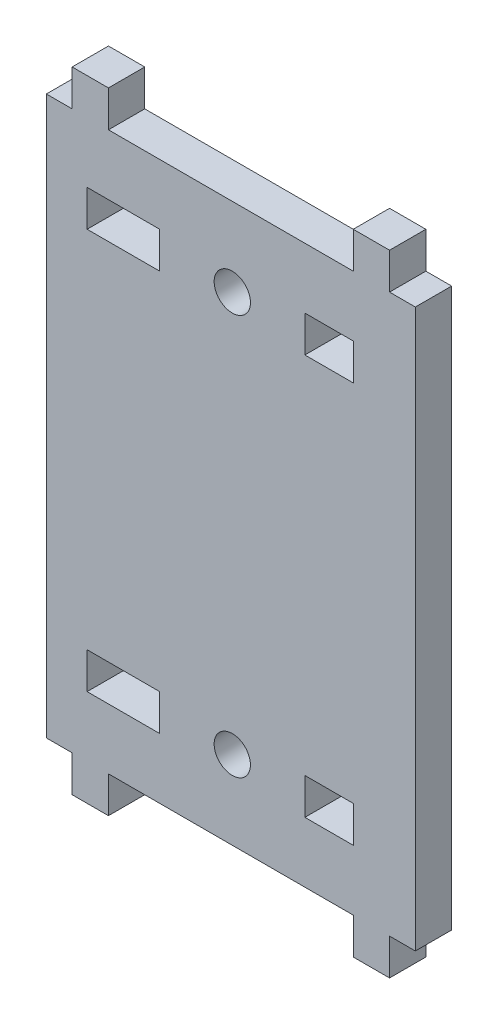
ISO-10303-21;
HEADER;
FILE_DESCRIPTION(('STEP AP214'),'2;1');
FILE_NAME('part.step','',(''),(''),'','','');
FILE_SCHEMA(('AUTOMOTIVE_DESIGN { 1 0 10303 214 1 1 1 1 }'));
ENDSEC;
DATA;
#1=APPLICATION_CONTEXT('core data for automotive mechanical design processes');
#2=APPLICATION_PROTOCOL_DEFINITION('international standard','automotive_design',2000,#1);
#3=PRODUCT_CONTEXT('',#1,'mechanical');
#4=PRODUCT('Part','Part','',(#3));
#5=PRODUCT_RELATED_PRODUCT_CATEGORY('part','',(#4));
#6=PRODUCT_DEFINITION_FORMATION('','',#4);
#7=PRODUCT_DEFINITION_CONTEXT('part definition',#1,'design');
#8=PRODUCT_DEFINITION('design','',#6,#7);
#9=PRODUCT_DEFINITION_SHAPE('','',#8);
#10=(LENGTH_UNIT() NAMED_UNIT(*) SI_UNIT(.MILLI.,.METRE.));
#11=(NAMED_UNIT(*) PLANE_ANGLE_UNIT() SI_UNIT($,.RADIAN.));
#12=(NAMED_UNIT(*) SI_UNIT($,.STERADIAN.) SOLID_ANGLE_UNIT());
#13=UNCERTAINTY_MEASURE_WITH_UNIT(LENGTH_MEASURE(1.E-05),#10,'distance_accuracy_value','');
#14=(GEOMETRIC_REPRESENTATION_CONTEXT(3) GLOBAL_UNCERTAINTY_ASSIGNED_CONTEXT((#13)) GLOBAL_UNIT_ASSIGNED_CONTEXT((#10,
#11,#12)) REPRESENTATION_CONTEXT('',''));
#15=CARTESIAN_POINT('',(0.,0.,0.));
#16=DIRECTION('',(0.,0.,1.));
#17=DIRECTION('',(1.,0.,0.));
#18=AXIS2_PLACEMENT_3D('',#15,#16,#17);
#19=CARTESIAN_POINT('',(0.,209.041147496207,3.));
#20=DIRECTION('',(0.,1.,0.));
#21=DIRECTION('',(0.,0.,1.));
#22=AXIS2_PLACEMENT_3D('',#19,#20,#21);
#23=PLANE('',#22);
#24=DIRECTION('',(1.,0.,0.));
#25=VECTOR('',#24,1.);
#26=CARTESIAN_POINT('',(0.,209.041147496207,0.));
#27=LINE('',#26,#25);
#28=CARTESIAN_POINT('',(45.8205985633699,209.041147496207,0.));
#29=VERTEX_POINT('',#28);
#30=CARTESIAN_POINT('',(47.95248356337,209.041147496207,0.));
#31=VERTEX_POINT('',#30);
#32=EDGE_CURVE('E362',#29,#31,#27,.T.);
#33=ORIENTED_EDGE('',*,*,#32,.F.);
#34=DIRECTION('',(0.,0.,-1.));
#35=VECTOR('',#34,1.);
#36=CARTESIAN_POINT('',(45.8205985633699,209.041147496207,3.));
#37=LINE('',#36,#35);
#38=CARTESIAN_POINT('',(45.8205985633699,209.041147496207,3.));
#39=VERTEX_POINT('',#38);
#40=EDGE_CURVE('E11',#39,#29,#37,.T.);
#41=ORIENTED_EDGE('',*,*,#40,.F.);
#42=DIRECTION('',(1.,0.,0.));
#43=VECTOR('',#42,1.);
#44=CARTESIAN_POINT('',(0.,209.041147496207,3.));
#45=LINE('',#44,#43);
#46=CARTESIAN_POINT('',(47.95248356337,209.041147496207,3.));
#47=VERTEX_POINT('',#46);
#48=EDGE_CURVE('E1035',#39,#47,#45,.T.);
#49=ORIENTED_EDGE('',*,*,#48,.T.);
#50=DIRECTION('',(0.,0.,-1.));
#51=VECTOR('',#50,1.);
#52=CARTESIAN_POINT('',(47.95248356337,209.041147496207,3.));
#53=LINE('',#52,#51);
#54=EDGE_CURVE('E174',#47,#31,#53,.T.);
#55=ORIENTED_EDGE('',*,*,#54,.T.);
#56=EDGE_LOOP('',(#33,#41,#49,#55));
#57=FACE_BOUND('',#56,.T.);
#58=ADVANCED_FACE('F36',(#57),#23,.T.);
#59=CARTESIAN_POINT('',(45.8205985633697,0.,3.));
#60=DIRECTION('',(1.,0.,0.));
#61=DIRECTION('',(0.,1.,0.));
#62=AXIS2_PLACEMENT_3D('',#59,#60,#61);
#63=PLANE('',#62);
#64=DIRECTION('',(0.,-1.,0.));
#65=VECTOR('',#64,1.);
#66=CARTESIAN_POINT('',(45.8205985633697,0.,0.));
#67=LINE('',#66,#65);
#68=CARTESIAN_POINT('',(45.8205985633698,162.941147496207,0.));
#69=VERTEX_POINT('',#68);
#70=EDGE_CURVE('E364',#29,#69,#67,.T.);
#71=ORIENTED_EDGE('',*,*,#70,.T.);
#72=DIRECTION('',(0.,0.,-1.));
#73=VECTOR('',#72,1.);
#74=CARTESIAN_POINT('',(45.8205985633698,162.941147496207,3.));
#75=LINE('',#74,#73);
#76=CARTESIAN_POINT('',(45.8205985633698,162.941147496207,3.));
#77=VERTEX_POINT('',#76);
#78=EDGE_CURVE('E46',#77,#69,#75,.T.);
#79=ORIENTED_EDGE('',*,*,#78,.F.);
#80=DIRECTION('',(0.,-1.,0.));
#81=VECTOR('',#80,1.);
#82=CARTESIAN_POINT('',(45.8205985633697,0.,3.));
#83=LINE('',#82,#81);
#84=EDGE_CURVE('E981',#39,#77,#83,.T.);
#85=ORIENTED_EDGE('',*,*,#84,.F.);
#86=ORIENTED_EDGE('',*,*,#40,.T.);
#87=EDGE_LOOP('',(#71,#79,#85,#86));
#88=FACE_BOUND('',#87,.T.);
#89=ADVANCED_FACE('F517',(#88),#63,.F.);
#90=CARTESIAN_POINT('',(0.,162.941147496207,3.));
#91=DIRECTION('',(0.,1.,0.));
#92=DIRECTION('',(0.,0.,1.));
#93=AXIS2_PLACEMENT_3D('',#90,#91,#92);
#94=PLANE('',#93);
#95=DIRECTION('',(1.,0.,0.));
#96=VECTOR('',#95,1.);
#97=CARTESIAN_POINT('',(0.,162.941147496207,0.));
#98=LINE('',#97,#96);
#99=CARTESIAN_POINT('',(47.95248356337,162.941147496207,0.));
#100=VERTEX_POINT('',#99);
#101=EDGE_CURVE('E367',#69,#100,#98,.T.);
#102=ORIENTED_EDGE('',*,*,#101,.T.);
#103=DIRECTION('',(0.,0.,-1.));
#104=VECTOR('',#103,1.);
#105=CARTESIAN_POINT('',(47.95248356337,162.941147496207,3.));
#106=LINE('',#105,#104);
#107=CARTESIAN_POINT('',(47.95248356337,162.941147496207,3.));
#108=VERTEX_POINT('',#107);
#109=EDGE_CURVE('E450',#108,#100,#106,.T.);
#110=ORIENTED_EDGE('',*,*,#109,.F.);
#111=DIRECTION('',(1.,0.,0.));
#112=VECTOR('',#111,1.);
#113=CARTESIAN_POINT('',(0.,162.941147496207,3.));
#114=LINE('',#113,#112);
#115=EDGE_CURVE('E977',#77,#108,#114,.T.);
#116=ORIENTED_EDGE('',*,*,#115,.F.);
#117=ORIENTED_EDGE('',*,*,#78,.T.);
#118=EDGE_LOOP('',(#102,#110,#116,#117));
#119=FACE_BOUND('',#118,.T.);
#120=ADVANCED_FACE('F522',(#119),#94,.F.);
#121=CARTESIAN_POINT('',(47.95248356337,0.,3.));
#122=DIRECTION('',(-1.,0.,0.));
#123=DIRECTION('',(0.,0.,1.));
#124=AXIS2_PLACEMENT_3D('',#121,#122,#123);
#125=PLANE('',#124);
#126=DIRECTION('',(0.,1.,0.));
#127=VECTOR('',#126,1.);
#128=CARTESIAN_POINT('',(47.95248356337,0.,0.));
#129=LINE('',#128,#127);
#130=CARTESIAN_POINT('',(47.95248356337,159.941147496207,0.));
#131=VERTEX_POINT('',#130);
#132=EDGE_CURVE('E370',#131,#100,#129,.T.);
#133=ORIENTED_EDGE('',*,*,#132,.F.);
#134=DIRECTION('',(0.,0.,-1.));
#135=VECTOR('',#134,1.);
#136=CARTESIAN_POINT('',(47.95248356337,159.941147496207,3.));
#137=LINE('',#136,#135);
#138=CARTESIAN_POINT('',(47.95248356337,159.941147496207,3.));
#139=VERTEX_POINT('',#138);
#140=EDGE_CURVE('E448',#139,#131,#137,.T.);
#141=ORIENTED_EDGE('',*,*,#140,.F.);
#142=DIRECTION('',(0.,1.,0.));
#143=VECTOR('',#142,1.);
#144=CARTESIAN_POINT('',(47.95248356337,0.,3.));
#145=LINE('',#144,#143);
#146=EDGE_CURVE('E973',#139,#108,#145,.T.);
#147=ORIENTED_EDGE('',*,*,#146,.T.);
#148=ORIENTED_EDGE('',*,*,#109,.T.);
#149=EDGE_LOOP('',(#133,#141,#147,#148));
#150=FACE_BOUND('',#149,.T.);
#151=ADVANCED_FACE('F919',(#150),#125,.T.);
#152=CARTESIAN_POINT('',(0.,159.941147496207,3.));
#153=DIRECTION('',(0.,-1.,0.));
#154=DIRECTION('',(0.,0.,-1.));
#155=AXIS2_PLACEMENT_3D('',#152,#153,#154);
#156=PLANE('',#155);
#157=DIRECTION('',(-1.,0.,0.));
#158=VECTOR('',#157,1.);
#159=CARTESIAN_POINT('',(0.,159.941147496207,0.));
#160=LINE('',#159,#158);
#161=CARTESIAN_POINT('',(50.9524835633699,159.941147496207,0.));
#162=VERTEX_POINT('',#161);
#163=EDGE_CURVE('E373',#162,#131,#160,.T.);
#164=ORIENTED_EDGE('',*,*,#163,.F.);
#165=DIRECTION('',(0.,0.,-1.));
#166=VECTOR('',#165,1.);
#167=CARTESIAN_POINT('',(50.9524835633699,159.941147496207,3.));
#168=LINE('',#167,#166);
#169=CARTESIAN_POINT('',(50.9524835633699,159.941147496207,3.));
#170=VERTEX_POINT('',#169);
#171=EDGE_CURVE('E446',#170,#162,#168,.T.);
#172=ORIENTED_EDGE('',*,*,#171,.F.);
#173=DIRECTION('',(-1.,0.,0.));
#174=VECTOR('',#173,1.);
#175=CARTESIAN_POINT('',(0.,159.941147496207,3.));
#176=LINE('',#175,#174);
#177=EDGE_CURVE('E976',#170,#139,#176,.T.);
#178=ORIENTED_EDGE('',*,*,#177,.T.);
#179=ORIENTED_EDGE('',*,*,#140,.T.);
#180=EDGE_LOOP('',(#164,#172,#178,#179));
#181=FACE_BOUND('',#180,.T.);
#182=ADVANCED_FACE('F909',(#181),#156,.T.);
#183=CARTESIAN_POINT('',(50.9524835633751,1.64991809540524E-12,3.));
#184=DIRECTION('',(-1.,0.,0.));
#185=DIRECTION('',(0.,-1.,0.));
#186=AXIS2_PLACEMENT_3D('',#183,#184,#185);
#187=PLANE('',#186);
#188=DIRECTION('',(0.,1.,0.));
#189=VECTOR('',#188,1.);
#190=CARTESIAN_POINT('',(50.9524835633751,1.64991809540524E-12,0.));
#191=LINE('',#190,#189);
#192=CARTESIAN_POINT('',(50.9524835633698,162.941147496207,0.));
#193=VERTEX_POINT('',#192);
#194=EDGE_CURVE('E376',#162,#193,#191,.T.);
#195=ORIENTED_EDGE('',*,*,#194,.T.);
#196=DIRECTION('',(0.,0.,-1.));
#197=VECTOR('',#196,1.);
#198=CARTESIAN_POINT('',(50.9524835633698,162.941147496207,3.));
#199=LINE('',#198,#197);
#200=CARTESIAN_POINT('',(50.9524835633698,162.941147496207,3.));
#201=VERTEX_POINT('',#200);
#202=EDGE_CURVE('E443',#201,#193,#199,.T.);
#203=ORIENTED_EDGE('',*,*,#202,.F.);
#204=DIRECTION('',(0.,1.,0.));
#205=VECTOR('',#204,1.);
#206=CARTESIAN_POINT('',(50.9524835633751,1.64991809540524E-12,3.));
#207=LINE('',#206,#205);
#208=EDGE_CURVE('E979',#170,#201,#207,.T.);
#209=ORIENTED_EDGE('',*,*,#208,.F.);
#210=ORIENTED_EDGE('',*,*,#171,.T.);
#211=EDGE_LOOP('',(#195,#203,#209,#210));
#212=FACE_BOUND('',#211,.T.);
#213=ADVANCED_FACE('F898',(#212),#187,.F.);
#214=CARTESIAN_POINT('',(0.,162.941147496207,3.));
#215=DIRECTION('',(0.,1.,0.));
#216=DIRECTION('',(0.,0.,1.));
#217=AXIS2_PLACEMENT_3D('',#214,#215,#216);
#218=PLANE('',#217);
#219=DIRECTION('',(1.,0.,0.));
#220=VECTOR('',#219,1.);
#221=CARTESIAN_POINT('',(0.,162.941147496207,0.));
#222=LINE('',#221,#220);
#223=CARTESIAN_POINT('',(71.1887140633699,162.941147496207,0.));
#224=VERTEX_POINT('',#223);
#225=EDGE_CURVE('E379',#193,#224,#222,.T.);
#226=ORIENTED_EDGE('',*,*,#225,.T.);
#227=DIRECTION('',(0.,0.,-1.));
#228=VECTOR('',#227,1.);
#229=CARTESIAN_POINT('',(71.1887140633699,162.941147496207,3.));
#230=LINE('',#229,#228);
#231=CARTESIAN_POINT('',(71.1887140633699,162.941147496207,3.));
#232=VERTEX_POINT('',#231);
#233=EDGE_CURVE('E441',#232,#224,#230,.T.);
#234=ORIENTED_EDGE('',*,*,#233,.F.);
#235=DIRECTION('',(1.,0.,0.));
#236=VECTOR('',#235,1.);
#237=CARTESIAN_POINT('',(0.,162.941147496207,3.));
#238=LINE('',#237,#236);
#239=EDGE_CURVE('E987',#201,#232,#238,.T.);
#240=ORIENTED_EDGE('',*,*,#239,.F.);
#241=ORIENTED_EDGE('',*,*,#202,.T.);
#242=EDGE_LOOP('',(#226,#234,#240,#241));
#243=FACE_BOUND('',#242,.T.);
#244=ADVANCED_FACE('F886',(#243),#218,.F.);
#245=CARTESIAN_POINT('',(71.1887140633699,0.,3.));
#246=DIRECTION('',(-1.,0.,0.));
#247=DIRECTION('',(0.,0.,1.));
#248=AXIS2_PLACEMENT_3D('',#245,#246,#247);
#249=PLANE('',#248);
#250=DIRECTION('',(0.,1.,0.));
#251=VECTOR('',#250,1.);
#252=CARTESIAN_POINT('',(71.1887140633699,0.,0.));
#253=LINE('',#252,#251);
#254=CARTESIAN_POINT('',(71.1887140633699,159.941147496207,0.));
#255=VERTEX_POINT('',#254);
#256=EDGE_CURVE('E382',#255,#224,#253,.T.);
#257=ORIENTED_EDGE('',*,*,#256,.F.);
#258=DIRECTION('',(0.,0.,-1.));
#259=VECTOR('',#258,1.);
#260=CARTESIAN_POINT('',(71.1887140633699,159.941147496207,3.));
#261=LINE('',#260,#259);
#262=CARTESIAN_POINT('',(71.1887140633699,159.941147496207,3.));
#263=VERTEX_POINT('',#262);
#264=EDGE_CURVE('E439',#263,#255,#261,.T.);
#265=ORIENTED_EDGE('',*,*,#264,.F.);
#266=DIRECTION('',(0.,1.,0.));
#267=VECTOR('',#266,1.);
#268=CARTESIAN_POINT('',(71.1887140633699,0.,3.));
#269=LINE('',#268,#267);
#270=EDGE_CURVE('E989',#263,#232,#269,.T.);
#271=ORIENTED_EDGE('',*,*,#270,.T.);
#272=ORIENTED_EDGE('',*,*,#233,.T.);
#273=EDGE_LOOP('',(#257,#265,#271,#272));
#274=FACE_BOUND('',#273,.T.);
#275=ADVANCED_FACE('F871',(#274),#249,.T.);
#276=CARTESIAN_POINT('',(0.,159.941147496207,3.));
#277=DIRECTION('',(0.,1.,0.));
#278=DIRECTION('',(0.,0.,1.));
#279=AXIS2_PLACEMENT_3D('',#276,#277,#278);
#280=PLANE('',#279);
#281=DIRECTION('',(1.,0.,0.));
#282=VECTOR('',#281,1.);
#283=CARTESIAN_POINT('',(0.,159.941147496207,0.));
#284=LINE('',#283,#282);
#285=CARTESIAN_POINT('',(74.1887140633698,159.941147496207,0.));
#286=VERTEX_POINT('',#285);
#287=EDGE_CURVE('E385',#255,#286,#284,.T.);
#288=ORIENTED_EDGE('',*,*,#287,.T.);
#289=DIRECTION('',(0.,0.,-1.));
#290=VECTOR('',#289,1.);
#291=CARTESIAN_POINT('',(74.1887140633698,159.941147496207,3.));
#292=LINE('',#291,#290);
#293=CARTESIAN_POINT('',(74.1887140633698,159.941147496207,3.));
#294=VERTEX_POINT('',#293);
#295=EDGE_CURVE('E436',#294,#286,#292,.T.);
#296=ORIENTED_EDGE('',*,*,#295,.F.);
#297=DIRECTION('',(1.,0.,0.));
#298=VECTOR('',#297,1.);
#299=CARTESIAN_POINT('',(0.,159.941147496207,3.));
#300=LINE('',#299,#298);
#301=EDGE_CURVE('E992',#263,#294,#300,.T.);
#302=ORIENTED_EDGE('',*,*,#301,.F.);
#303=ORIENTED_EDGE('',*,*,#264,.T.);
#304=EDGE_LOOP('',(#288,#296,#302,#303));
#305=FACE_BOUND('',#304,.T.);
#306=ADVANCED_FACE('F861',(#305),#280,.F.);
#307=CARTESIAN_POINT('',(74.1887140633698,0.,3.));
#308=DIRECTION('',(-1.,0.,0.));
#309=DIRECTION('',(0.,0.,1.));
#310=AXIS2_PLACEMENT_3D('',#307,#308,#309);
#311=PLANE('',#310);
#312=DIRECTION('',(0.,1.,0.));
#313=VECTOR('',#312,1.);
#314=CARTESIAN_POINT('',(74.1887140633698,0.,0.));
#315=LINE('',#314,#313);
#316=CARTESIAN_POINT('',(74.1887140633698,162.941147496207,0.));
#317=VERTEX_POINT('',#316);
#318=EDGE_CURVE('E388',#286,#317,#315,.T.);
#319=ORIENTED_EDGE('',*,*,#318,.T.);
#320=DIRECTION('',(0.,0.,-1.));
#321=VECTOR('',#320,1.);
#322=CARTESIAN_POINT('',(74.1887140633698,162.941147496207,3.));
#323=LINE('',#322,#321);
#324=CARTESIAN_POINT('',(74.1887140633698,162.941147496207,3.));
#325=VERTEX_POINT('',#324);
#326=EDGE_CURVE('E433',#325,#317,#323,.T.);
#327=ORIENTED_EDGE('',*,*,#326,.F.);
#328=DIRECTION('',(0.,1.,0.));
#329=VECTOR('',#328,1.);
#330=CARTESIAN_POINT('',(74.1887140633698,0.,3.));
#331=LINE('',#330,#329);
#332=EDGE_CURVE('E995',#294,#325,#331,.T.);
#333=ORIENTED_EDGE('',*,*,#332,.F.);
#334=ORIENTED_EDGE('',*,*,#295,.T.);
#335=EDGE_LOOP('',(#319,#327,#333,#334));
#336=FACE_BOUND('',#335,.T.);
#337=ADVANCED_FACE('F853',(#336),#311,.F.);
#338=CARTESIAN_POINT('',(0.,162.941147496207,3.));
#339=DIRECTION('',(0.,1.,0.));
#340=DIRECTION('',(0.,0.,1.));
#341=AXIS2_PLACEMENT_3D('',#338,#339,#340);
#342=PLANE('',#341);
#343=DIRECTION('',(1.,0.,0.));
#344=VECTOR('',#343,1.);
#345=CARTESIAN_POINT('',(0.,162.941147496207,0.));
#346=LINE('',#345,#344);
#347=CARTESIAN_POINT('',(76.32059906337,162.941147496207,0.));
#348=VERTEX_POINT('',#347);
#349=EDGE_CURVE('E391',#317,#348,#346,.T.);
#350=ORIENTED_EDGE('',*,*,#349,.T.);
#351=DIRECTION('',(0.,0.,-1.));
#352=VECTOR('',#351,1.);
#353=CARTESIAN_POINT('',(76.32059906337,162.941147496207,3.));
#354=LINE('',#353,#352);
#355=CARTESIAN_POINT('',(76.32059906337,162.941147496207,3.));
#356=VERTEX_POINT('',#355);
#357=EDGE_CURVE('E431',#356,#348,#354,.T.);
#358=ORIENTED_EDGE('',*,*,#357,.F.);
#359=DIRECTION('',(1.,0.,0.));
#360=VECTOR('',#359,1.);
#361=CARTESIAN_POINT('',(0.,162.941147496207,3.));
#362=LINE('',#361,#360);
#363=EDGE_CURVE('E998',#325,#356,#362,.T.);
#364=ORIENTED_EDGE('',*,*,#363,.F.);
#365=ORIENTED_EDGE('',*,*,#326,.T.);
#366=EDGE_LOOP('',(#350,#358,#364,#365));
#367=FACE_BOUND('',#366,.T.);
#368=ADVANCED_FACE('F674',(#367),#342,.F.);
#369=CARTESIAN_POINT('',(76.32059906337,0.,3.));
#370=DIRECTION('',(1.,0.,0.));
#371=DIRECTION('',(0.,0.,-1.));
#372=AXIS2_PLACEMENT_3D('',#369,#370,#371);
#373=PLANE('',#372);
#374=DIRECTION('',(0.,-1.,0.));
#375=VECTOR('',#374,1.);
#376=CARTESIAN_POINT('',(76.32059906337,0.,0.));
#377=LINE('',#376,#375);
#378=CARTESIAN_POINT('',(76.32059906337,209.041147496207,0.));
#379=VERTEX_POINT('',#378);
#380=EDGE_CURVE('E394',#379,#348,#377,.T.);
#381=ORIENTED_EDGE('',*,*,#380,.F.);
#382=DIRECTION('',(0.,0.,-1.));
#383=VECTOR('',#382,1.);
#384=CARTESIAN_POINT('',(76.32059906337,209.041147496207,3.));
#385=LINE('',#384,#383);
#386=CARTESIAN_POINT('',(76.32059906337,209.041147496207,3.));
#387=VERTEX_POINT('',#386);
#388=EDGE_CURVE('E429',#387,#379,#385,.T.);
#389=ORIENTED_EDGE('',*,*,#388,.F.);
#390=DIRECTION('',(0.,-1.,0.));
#391=VECTOR('',#390,1.);
#392=CARTESIAN_POINT('',(76.32059906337,0.,3.));
#393=LINE('',#392,#391);
#394=EDGE_CURVE('E1000',#387,#356,#393,.T.);
#395=ORIENTED_EDGE('',*,*,#394,.T.);
#396=ORIENTED_EDGE('',*,*,#357,.T.);
#397=EDGE_LOOP('',(#381,#389,#395,#396));
#398=FACE_BOUND('',#397,.T.);
#399=ADVANCED_FACE('F669',(#398),#373,.T.);
#400=CARTESIAN_POINT('',(0.,209.041147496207,3.));
#401=DIRECTION('',(0.,1.,0.));
#402=DIRECTION('',(0.,0.,1.));
#403=AXIS2_PLACEMENT_3D('',#400,#401,#402);
#404=PLANE('',#403);
#405=DIRECTION('',(1.,0.,0.));
#406=VECTOR('',#405,1.);
#407=CARTESIAN_POINT('',(0.,209.041147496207,0.));
#408=LINE('',#407,#406);
#409=CARTESIAN_POINT('',(74.1887140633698,209.041147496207,0.));
#410=VERTEX_POINT('',#409);
#411=EDGE_CURVE('E397',#410,#379,#408,.T.);
#412=ORIENTED_EDGE('',*,*,#411,.F.);
#413=DIRECTION('',(0.,0.,-1.));
#414=VECTOR('',#413,1.);
#415=CARTESIAN_POINT('',(74.1887140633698,209.041147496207,3.));
#416=LINE('',#415,#414);
#417=CARTESIAN_POINT('',(74.1887140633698,209.041147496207,3.));
#418=VERTEX_POINT('',#417);
#419=EDGE_CURVE('E427',#418,#410,#416,.T.);
#420=ORIENTED_EDGE('',*,*,#419,.F.);
#421=DIRECTION('',(1.,0.,0.));
#422=VECTOR('',#421,1.);
#423=CARTESIAN_POINT('',(0.,209.041147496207,3.));
#424=LINE('',#423,#422);
#425=EDGE_CURVE('E1003',#418,#387,#424,.T.);
#426=ORIENTED_EDGE('',*,*,#425,.T.);
#427=ORIENTED_EDGE('',*,*,#388,.T.);
#428=EDGE_LOOP('',(#412,#420,#426,#427));
#429=FACE_BOUND('',#428,.T.);
#430=ADVANCED_FACE('F673',(#429),#404,.T.);
#431=CARTESIAN_POINT('',(74.1887140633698,0.,3.));
#432=DIRECTION('',(1.,0.,0.));
#433=DIRECTION('',(0.,0.,-1.));
#434=AXIS2_PLACEMENT_3D('',#431,#432,#433);
#435=PLANE('',#434);
#436=DIRECTION('',(0.,-1.,0.));
#437=VECTOR('',#436,1.);
#438=CARTESIAN_POINT('',(74.1887140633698,0.,0.));
#439=LINE('',#438,#437);
#440=CARTESIAN_POINT('',(74.1887140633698,212.041147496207,0.));
#441=VERTEX_POINT('',#440);
#442=EDGE_CURVE('E400',#441,#410,#439,.T.);
#443=ORIENTED_EDGE('',*,*,#442,.F.);
#444=DIRECTION('',(0.,0.,-1.));
#445=VECTOR('',#444,1.);
#446=CARTESIAN_POINT('',(74.1887140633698,212.041147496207,3.));
#447=LINE('',#446,#445);
#448=CARTESIAN_POINT('',(74.1887140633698,212.041147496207,3.));
#449=VERTEX_POINT('',#448);
#450=EDGE_CURVE('E425',#449,#441,#447,.T.);
#451=ORIENTED_EDGE('',*,*,#450,.F.);
#452=DIRECTION('',(0.,-1.,0.));
#453=VECTOR('',#452,1.);
#454=CARTESIAN_POINT('',(74.1887140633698,0.,3.));
#455=LINE('',#454,#453);
#456=EDGE_CURVE('E1006',#449,#418,#455,.T.);
#457=ORIENTED_EDGE('',*,*,#456,.T.);
#458=ORIENTED_EDGE('',*,*,#419,.T.);
#459=EDGE_LOOP('',(#443,#451,#457,#458));
#460=FACE_BOUND('',#459,.T.);
#461=ADVANCED_FACE('F689',(#460),#435,.T.);
#462=CARTESIAN_POINT('',(0.,212.041147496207,3.));
#463=DIRECTION('',(0.,1.,0.));
#464=DIRECTION('',(0.,0.,1.));
#465=AXIS2_PLACEMENT_3D('',#462,#463,#464);
#466=PLANE('',#465);
#467=DIRECTION('',(1.,0.,0.));
#468=VECTOR('',#467,1.);
#469=CARTESIAN_POINT('',(0.,212.041147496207,0.));
#470=LINE('',#469,#468);
#471=CARTESIAN_POINT('',(71.1887140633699,212.041147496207,0.));
#472=VERTEX_POINT('',#471);
#473=EDGE_CURVE('E403',#472,#441,#470,.T.);
#474=ORIENTED_EDGE('',*,*,#473,.F.);
#475=DIRECTION('',(0.,0.,-1.));
#476=VECTOR('',#475,1.);
#477=CARTESIAN_POINT('',(71.1887140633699,212.041147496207,3.));
#478=LINE('',#477,#476);
#479=CARTESIAN_POINT('',(71.1887140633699,212.041147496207,3.));
#480=VERTEX_POINT('',#479);
#481=EDGE_CURVE('E423',#480,#472,#478,.T.);
#482=ORIENTED_EDGE('',*,*,#481,.F.);
#483=DIRECTION('',(1.,0.,0.));
#484=VECTOR('',#483,1.);
#485=CARTESIAN_POINT('',(0.,212.041147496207,3.));
#486=LINE('',#485,#484);
#487=EDGE_CURVE('E1009',#480,#449,#486,.T.);
#488=ORIENTED_EDGE('',*,*,#487,.T.);
#489=ORIENTED_EDGE('',*,*,#450,.T.);
#490=EDGE_LOOP('',(#474,#482,#488,#489));
#491=FACE_BOUND('',#490,.T.);
#492=ADVANCED_FACE('F697',(#491),#466,.T.);
#493=CARTESIAN_POINT('',(71.1887140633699,0.,3.));
#494=DIRECTION('',(1.,0.,0.));
#495=DIRECTION('',(0.,0.,-1.));
#496=AXIS2_PLACEMENT_3D('',#493,#494,#495);
#497=PLANE('',#496);
#498=DIRECTION('',(0.,-1.,0.));
#499=VECTOR('',#498,1.);
#500=CARTESIAN_POINT('',(71.1887140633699,0.,0.));
#501=LINE('',#500,#499);
#502=CARTESIAN_POINT('',(71.1887140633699,209.041147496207,0.));
#503=VERTEX_POINT('',#502);
#504=EDGE_CURVE('E406',#472,#503,#501,.T.);
#505=ORIENTED_EDGE('',*,*,#504,.T.);
#506=DIRECTION('',(0.,0.,-1.));
#507=VECTOR('',#506,1.);
#508=CARTESIAN_POINT('',(71.1887140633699,209.041147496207,3.));
#509=LINE('',#508,#507);
#510=CARTESIAN_POINT('',(71.1887140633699,209.041147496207,3.));
#511=VERTEX_POINT('',#510);
#512=EDGE_CURVE('E421',#511,#503,#509,.T.);
#513=ORIENTED_EDGE('',*,*,#512,.F.);
#514=DIRECTION('',(0.,-1.,0.));
#515=VECTOR('',#514,1.);
#516=CARTESIAN_POINT('',(71.1887140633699,0.,3.));
#517=LINE('',#516,#515);
#518=EDGE_CURVE('E302',#480,#511,#517,.T.);
#519=ORIENTED_EDGE('',*,*,#518,.F.);
#520=ORIENTED_EDGE('',*,*,#481,.T.);
#521=EDGE_LOOP('',(#505,#513,#519,#520));
#522=FACE_BOUND('',#521,.T.);
#523=ADVANCED_FACE('F705',(#522),#497,.F.);
#524=CARTESIAN_POINT('',(0.,209.041147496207,3.));
#525=DIRECTION('',(0.,1.,0.));
#526=DIRECTION('',(0.,0.,1.));
#527=AXIS2_PLACEMENT_3D('',#524,#525,#526);
#528=PLANE('',#527);
#529=DIRECTION('',(1.,0.,0.));
#530=VECTOR('',#529,1.);
#531=CARTESIAN_POINT('',(0.,209.041147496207,0.));
#532=LINE('',#531,#530);
#533=CARTESIAN_POINT('',(50.9524835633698,209.041147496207,0.));
#534=VERTEX_POINT('',#533);
#535=EDGE_CURVE('E409',#534,#503,#532,.T.);
#536=ORIENTED_EDGE('',*,*,#535,.F.);
#537=DIRECTION('',(0.,0.,-1.));
#538=VECTOR('',#537,1.);
#539=CARTESIAN_POINT('',(50.9524835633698,209.041147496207,3.));
#540=LINE('',#539,#538);
#541=CARTESIAN_POINT('',(50.9524835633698,209.041147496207,3.));
#542=VERTEX_POINT('',#541);
#543=EDGE_CURVE('E290',#542,#534,#540,.T.);
#544=ORIENTED_EDGE('',*,*,#543,.F.);
#545=DIRECTION('',(1.,0.,0.));
#546=VECTOR('',#545,1.);
#547=CARTESIAN_POINT('',(0.,209.041147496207,3.));
#548=LINE('',#547,#546);
#549=EDGE_CURVE('E300',#542,#511,#548,.T.);
#550=ORIENTED_EDGE('',*,*,#549,.T.);
#551=ORIENTED_EDGE('',*,*,#512,.T.);
#552=EDGE_LOOP('',(#536,#544,#550,#551));
#553=FACE_BOUND('',#552,.T.);
#554=ADVANCED_FACE('F664',(#553),#528,.T.);
#555=CARTESIAN_POINT('',(50.952483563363,-1.64991809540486E-12,3.));
#556=DIRECTION('',(1.,0.,0.));
#557=DIRECTION('',(0.,1.,0.));
#558=AXIS2_PLACEMENT_3D('',#555,#556,#557);
#559=PLANE('',#558);
#560=DIRECTION('',(0.,-1.,0.));
#561=VECTOR('',#560,1.);
#562=CARTESIAN_POINT('',(50.952483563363,-1.64991809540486E-12,0.));
#563=LINE('',#562,#561);
#564=CARTESIAN_POINT('',(50.9524835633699,212.041147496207,0.));
#565=VERTEX_POINT('',#564);
#566=EDGE_CURVE('E287',#565,#534,#563,.T.);
#567=ORIENTED_EDGE('',*,*,#566,.F.);
#568=DIRECTION('',(0.,0.,-1.));
#569=VECTOR('',#568,1.);
#570=CARTESIAN_POINT('',(50.9524835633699,212.041147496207,3.));
#571=LINE('',#570,#569);
#572=CARTESIAN_POINT('',(50.9524835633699,212.041147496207,3.));
#573=VERTEX_POINT('',#572);
#574=EDGE_CURVE('E281',#573,#565,#571,.T.);
#575=ORIENTED_EDGE('',*,*,#574,.F.);
#576=DIRECTION('',(0.,-1.,0.));
#577=VECTOR('',#576,1.);
#578=CARTESIAN_POINT('',(50.952483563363,-1.64991809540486E-12,3.));
#579=LINE('',#578,#577);
#580=EDGE_CURVE('E285',#573,#542,#579,.T.);
#581=ORIENTED_EDGE('',*,*,#580,.T.);
#582=ORIENTED_EDGE('',*,*,#543,.T.);
#583=EDGE_LOOP('',(#567,#575,#581,#582));
#584=FACE_BOUND('',#583,.T.);
#585=ADVANCED_FACE('F283',(#584),#559,.T.);
#586=CARTESIAN_POINT('',(0.,212.041147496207,3.));
#587=DIRECTION('',(0.,-1.,0.));
#588=DIRECTION('',(0.,0.,-1.));
#589=AXIS2_PLACEMENT_3D('',#586,#587,#588);
#590=PLANE('',#589);
#591=DIRECTION('',(-1.,0.,0.));
#592=VECTOR('',#591,1.);
#593=CARTESIAN_POINT('',(0.,212.041147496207,0.));
#594=LINE('',#593,#592);
#595=CARTESIAN_POINT('',(47.95248356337,212.041147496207,0.));
#596=VERTEX_POINT('',#595);
#597=EDGE_CURVE('E413',#565,#596,#594,.T.);
#598=ORIENTED_EDGE('',*,*,#597,.T.);
#599=DIRECTION('',(0.,0.,-1.));
#600=VECTOR('',#599,1.);
#601=CARTESIAN_POINT('',(47.95248356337,212.041147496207,3.));
#602=LINE('',#601,#600);
#603=CARTESIAN_POINT('',(47.95248356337,212.041147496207,3.));
#604=VERTEX_POINT('',#603);
#605=EDGE_CURVE('E291',#604,#596,#602,.T.);
#606=ORIENTED_EDGE('',*,*,#605,.F.);
#607=DIRECTION('',(-1.,0.,0.));
#608=VECTOR('',#607,1.);
#609=CARTESIAN_POINT('',(0.,212.041147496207,3.));
#610=LINE('',#609,#608);
#611=EDGE_CURVE('E294',#573,#604,#610,.T.);
#612=ORIENTED_EDGE('',*,*,#611,.F.);
#613=ORIENTED_EDGE('',*,*,#574,.T.);
#614=EDGE_LOOP('',(#598,#606,#612,#613));
#615=FACE_BOUND('',#614,.T.);
#616=ADVANCED_FACE('F295',(#615),#590,.F.);
#617=CARTESIAN_POINT('',(71.1887140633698,0.,3.));
#618=DIRECTION('',(-1.,0.,0.));
#619=DIRECTION('',(0.,0.,1.));
#620=AXIS2_PLACEMENT_3D('',#617,#618,#619);
#621=PLANE('',#620);
#622=DIRECTION('',(0.,1.,0.));
#623=VECTOR('',#622,1.);
#624=CARTESIAN_POINT('',(71.1887140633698,0.,0.));
#625=LINE('',#624,#623);
#626=CARTESIAN_POINT('',(71.1887140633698,201.041147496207,0.));
#627=VERTEX_POINT('',#626);
#628=CARTESIAN_POINT('',(71.1887140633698,204.041147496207,0.));
#629=VERTEX_POINT('',#628);
#630=EDGE_CURVE('E350',#627,#629,#625,.T.);
#631=ORIENTED_EDGE('',*,*,#630,.F.);
#632=DIRECTION('',(0.,0.,-1.));
#633=VECTOR('',#632,1.);
#634=CARTESIAN_POINT('',(71.1887140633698,201.041147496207,3.));
#635=LINE('',#634,#633);
#636=CARTESIAN_POINT('',(71.1887140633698,201.041147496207,3.));
#637=VERTEX_POINT('',#636);
#638=EDGE_CURVE('E418',#637,#627,#635,.T.);
#639=ORIENTED_EDGE('',*,*,#638,.F.);
#640=DIRECTION('',(0.,1.,0.));
#641=VECTOR('',#640,1.);
#642=CARTESIAN_POINT('',(71.1887140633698,0.,3.));
#643=LINE('',#642,#641);
#644=CARTESIAN_POINT('',(71.1887140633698,204.041147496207,3.));
#645=VERTEX_POINT('',#644);
#646=EDGE_CURVE('E1045',#637,#645,#643,.T.);
#647=ORIENTED_EDGE('',*,*,#646,.T.);
#648=DIRECTION('',(0.,0.,-1.));
#649=VECTOR('',#648,1.);
#650=CARTESIAN_POINT('',(71.1887140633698,204.041147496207,3.));
#651=LINE('',#650,#649);
#652=EDGE_CURVE('E454',#645,#629,#651,.T.);
#653=ORIENTED_EDGE('',*,*,#652,.T.);
#654=EDGE_LOOP('',(#631,#639,#647,#653));
#655=FACE_BOUND('',#654,.T.);
#656=ADVANCED_FACE('F535',(#655),#621,.T.);
#657=CARTESIAN_POINT('',(0.,201.041147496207,3.));
#658=DIRECTION('',(0.,-1.,0.));
#659=DIRECTION('',(0.,0.,-1.));
#660=AXIS2_PLACEMENT_3D('',#657,#658,#659);
#661=PLANE('',#660);
#662=DIRECTION('',(-1.,0.,0.));
#663=VECTOR('',#662,1.);
#664=CARTESIAN_POINT('',(0.,201.041147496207,0.));
#665=LINE('',#664,#663);
#666=CARTESIAN_POINT('',(67.1887140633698,201.041147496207,0.));
#667=VERTEX_POINT('',#666);
#668=EDGE_CURVE('E353',#627,#667,#665,.T.);
#669=ORIENTED_EDGE('',*,*,#668,.T.);
#670=DIRECTION('',(0.,0.,-1.));
#671=VECTOR('',#670,1.);
#672=CARTESIAN_POINT('',(67.1887140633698,201.041147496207,3.));
#673=LINE('',#672,#671);
#674=CARTESIAN_POINT('',(67.1887140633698,201.041147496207,3.));
#675=VERTEX_POINT('',#674);
#676=EDGE_CURVE('E459',#675,#667,#673,.T.);
#677=ORIENTED_EDGE('',*,*,#676,.F.);
#678=DIRECTION('',(-1.,0.,0.));
#679=VECTOR('',#678,1.);
#680=CARTESIAN_POINT('',(0.,201.041147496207,3.));
#681=LINE('',#680,#679);
#682=EDGE_CURVE('E1043',#637,#675,#681,.T.);
#683=ORIENTED_EDGE('',*,*,#682,.F.);
#684=ORIENTED_EDGE('',*,*,#638,.T.);
#685=EDGE_LOOP('',(#669,#677,#683,#684));
#686=FACE_BOUND('',#685,.T.);
#687=ADVANCED_FACE('F531',(#686),#661,.F.);
#688=CARTESIAN_POINT('',(67.1887140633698,0.,3.));
#689=DIRECTION('',(1.,0.,0.));
#690=DIRECTION('',(0.,0.,-1.));
#691=AXIS2_PLACEMENT_3D('',#688,#689,#690);
#692=PLANE('',#691);
#693=DIRECTION('',(0.,-1.,0.));
#694=VECTOR('',#693,1.);
#695=CARTESIAN_POINT('',(67.1887140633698,0.,0.));
#696=LINE('',#695,#694);
#697=CARTESIAN_POINT('',(67.1887140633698,204.041147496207,0.));
#698=VERTEX_POINT('',#697);
#699=EDGE_CURVE('E356',#698,#667,#696,.T.);
#700=ORIENTED_EDGE('',*,*,#699,.F.);
#701=DIRECTION('',(0.,0.,-1.));
#702=VECTOR('',#701,1.);
#703=CARTESIAN_POINT('',(67.1887140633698,204.041147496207,3.));
#704=LINE('',#703,#702);
#705=CARTESIAN_POINT('',(67.1887140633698,204.041147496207,3.));
#706=VERTEX_POINT('',#705);
#707=EDGE_CURVE('E456',#706,#698,#704,.T.);
#708=ORIENTED_EDGE('',*,*,#707,.F.);
#709=DIRECTION('',(0.,-1.,0.));
#710=VECTOR('',#709,1.);
#711=CARTESIAN_POINT('',(67.1887140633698,0.,3.));
#712=LINE('',#711,#710);
#713=EDGE_CURVE('E1040',#706,#675,#712,.T.);
#714=ORIENTED_EDGE('',*,*,#713,.T.);
#715=ORIENTED_EDGE('',*,*,#676,.T.);
#716=EDGE_LOOP('',(#700,#708,#714,#715));
#717=FACE_BOUND('',#716,.T.);
#718=ADVANCED_FACE('F527',(#717),#692,.T.);
#719=CARTESIAN_POINT('',(49.1887140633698,0.,3.));
#720=DIRECTION('',(1.,0.,0.));
#721=DIRECTION('',(0.,0.,-1.));
#722=AXIS2_PLACEMENT_3D('',#719,#720,#721);
#723=PLANE('',#722);
#724=DIRECTION('',(0.,-1.,0.));
#725=VECTOR('',#724,1.);
#726=CARTESIAN_POINT('',(49.1887140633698,0.,0.));
#727=LINE('',#726,#725);
#728=CARTESIAN_POINT('',(49.1887140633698,204.041147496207,0.));
#729=VERTEX_POINT('',#728);
#730=CARTESIAN_POINT('',(49.1887140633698,201.041147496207,0.));
#731=VERTEX_POINT('',#730);
#732=EDGE_CURVE('E338',#729,#731,#727,.T.);
#733=ORIENTED_EDGE('',*,*,#732,.F.);
#734=DIRECTION('',(0.,0.,-1.));
#735=VECTOR('',#734,1.);
#736=CARTESIAN_POINT('',(49.1887140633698,204.041147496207,3.));
#737=LINE('',#736,#735);
#738=CARTESIAN_POINT('',(49.1887140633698,204.041147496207,3.));
#739=VERTEX_POINT('',#738);
#740=EDGE_CURVE('E457',#739,#729,#737,.T.);
#741=ORIENTED_EDGE('',*,*,#740,.F.);
#742=DIRECTION('',(0.,-1.,0.));
#743=VECTOR('',#742,1.);
#744=CARTESIAN_POINT('',(49.1887140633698,0.,3.));
#745=LINE('',#744,#743);
#746=CARTESIAN_POINT('',(49.1887140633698,201.041147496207,3.));
#747=VERTEX_POINT('',#746);
#748=EDGE_CURVE('E1056',#739,#747,#745,.T.);
#749=ORIENTED_EDGE('',*,*,#748,.T.);
#750=DIRECTION('',(0.,0.,-1.));
#751=VECTOR('',#750,1.);
#752=CARTESIAN_POINT('',(49.1887140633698,201.041147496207,3.));
#753=LINE('',#752,#751);
#754=EDGE_CURVE('E462',#747,#731,#753,.T.);
#755=ORIENTED_EDGE('',*,*,#754,.T.);
#756=EDGE_LOOP('',(#733,#741,#749,#755));
#757=FACE_BOUND('',#756,.T.);
#758=ADVANCED_FACE('F530',(#757),#723,.T.);
#759=CARTESIAN_POINT('',(0.,204.041147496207,3.));
#760=DIRECTION('',(0.,-1.,0.));
#761=DIRECTION('',(0.,0.,-1.));
#762=AXIS2_PLACEMENT_3D('',#759,#760,#761);
#763=PLANE('',#762);
#764=DIRECTION('',(-1.,0.,0.));
#765=VECTOR('',#764,1.);
#766=CARTESIAN_POINT('',(0.,204.041147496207,0.));
#767=LINE('',#766,#765);
#768=CARTESIAN_POINT('',(55.1887140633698,204.041147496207,0.));
#769=VERTEX_POINT('',#768);
#770=EDGE_CURVE('E341',#769,#729,#767,.T.);
#771=ORIENTED_EDGE('',*,*,#770,.F.);
#772=DIRECTION('',(0.,0.,-1.));
#773=VECTOR('',#772,1.);
#774=CARTESIAN_POINT('',(55.1887140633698,204.041147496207,3.));
#775=LINE('',#774,#773);
#776=CARTESIAN_POINT('',(55.1887140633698,204.041147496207,3.));
#777=VERTEX_POINT('',#776);
#778=EDGE_CURVE('E468',#777,#769,#775,.T.);
#779=ORIENTED_EDGE('',*,*,#778,.F.);
#780=DIRECTION('',(-1.,0.,0.));
#781=VECTOR('',#780,1.);
#782=CARTESIAN_POINT('',(0.,204.041147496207,3.));
#783=LINE('',#782,#781);
#784=EDGE_CURVE('E1053',#777,#739,#783,.T.);
#785=ORIENTED_EDGE('',*,*,#784,.T.);
#786=ORIENTED_EDGE('',*,*,#740,.T.);
#787=EDGE_LOOP('',(#771,#779,#785,#786));
#788=FACE_BOUND('',#787,.T.);
#789=ADVANCED_FACE('F548',(#788),#763,.T.);
#790=CARTESIAN_POINT('',(55.1887140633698,0.,3.));
#791=DIRECTION('',(1.,0.,0.));
#792=DIRECTION('',(0.,0.,-1.));
#793=AXIS2_PLACEMENT_3D('',#790,#791,#792);
#794=PLANE('',#793);
#795=DIRECTION('',(0.,-1.,0.));
#796=VECTOR('',#795,1.);
#797=CARTESIAN_POINT('',(55.1887140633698,0.,0.));
#798=LINE('',#797,#796);
#799=CARTESIAN_POINT('',(55.1887140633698,201.041147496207,0.));
#800=VERTEX_POINT('',#799);
#801=EDGE_CURVE('E344',#769,#800,#798,.T.);
#802=ORIENTED_EDGE('',*,*,#801,.T.);
#803=DIRECTION('',(0.,0.,-1.));
#804=VECTOR('',#803,1.);
#805=CARTESIAN_POINT('',(55.1887140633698,201.041147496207,3.));
#806=LINE('',#805,#804);
#807=CARTESIAN_POINT('',(55.1887140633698,201.041147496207,3.));
#808=VERTEX_POINT('',#807);
#809=EDGE_CURVE('E464',#808,#800,#806,.T.);
#810=ORIENTED_EDGE('',*,*,#809,.F.);
#811=DIRECTION('',(0.,-1.,0.));
#812=VECTOR('',#811,1.);
#813=CARTESIAN_POINT('',(55.1887140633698,0.,3.));
#814=LINE('',#813,#812);
#815=EDGE_CURVE('E1050',#777,#808,#814,.T.);
#816=ORIENTED_EDGE('',*,*,#815,.F.);
#817=ORIENTED_EDGE('',*,*,#778,.T.);
#818=EDGE_LOOP('',(#802,#810,#816,#817));
#819=FACE_BOUND('',#818,.T.);
#820=ADVANCED_FACE('F544',(#819),#794,.F.);
#821=CARTESIAN_POINT('',(0.,167.941147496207,3.));
#822=DIRECTION('',(0.,-1.,0.));
#823=DIRECTION('',(0.,0.,-1.));
#824=AXIS2_PLACEMENT_3D('',#821,#822,#823);
#825=PLANE('',#824);
#826=DIRECTION('',(-1.,0.,0.));
#827=VECTOR('',#826,1.);
#828=CARTESIAN_POINT('',(0.,167.941147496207,0.));
#829=LINE('',#828,#827);
#830=CARTESIAN_POINT('',(55.1887140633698,167.941147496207,0.));
#831=VERTEX_POINT('',#830);
#832=CARTESIAN_POINT('',(49.1887140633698,167.941147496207,0.));
#833=VERTEX_POINT('',#832);
#834=EDGE_CURVE('E326',#831,#833,#829,.T.);
#835=ORIENTED_EDGE('',*,*,#834,.T.);
#836=DIRECTION('',(0.,0.,-1.));
#837=VECTOR('',#836,1.);
#838=CARTESIAN_POINT('',(49.1887140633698,167.941147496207,3.));
#839=LINE('',#838,#837);
#840=CARTESIAN_POINT('',(49.1887140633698,167.941147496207,3.));
#841=VERTEX_POINT('',#840);
#842=EDGE_CURVE('E465',#841,#833,#839,.T.);
#843=ORIENTED_EDGE('',*,*,#842,.F.);
#844=DIRECTION('',(-1.,0.,0.));
#845=VECTOR('',#844,1.);
#846=CARTESIAN_POINT('',(0.,167.941147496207,3.));
#847=LINE('',#846,#845);
#848=CARTESIAN_POINT('',(55.1887140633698,167.941147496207,3.));
#849=VERTEX_POINT('',#848);
#850=EDGE_CURVE('E1067',#849,#841,#847,.T.);
#851=ORIENTED_EDGE('',*,*,#850,.F.);
#852=DIRECTION('',(0.,0.,-1.));
#853=VECTOR('',#852,1.);
#854=CARTESIAN_POINT('',(55.1887140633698,167.941147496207,3.));
#855=LINE('',#854,#853);
#856=EDGE_CURVE('E471',#849,#831,#855,.T.);
#857=ORIENTED_EDGE('',*,*,#856,.T.);
#858=EDGE_LOOP('',(#835,#843,#851,#857));
#859=FACE_BOUND('',#858,.T.);
#860=ADVANCED_FACE('F547',(#859),#825,.F.);
#861=CARTESIAN_POINT('',(49.1887140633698,0.,3.));
#862=DIRECTION('',(-1.,0.,0.));
#863=DIRECTION('',(0.,0.,1.));
#864=AXIS2_PLACEMENT_3D('',#861,#862,#863);
#865=PLANE('',#864);
#866=DIRECTION('',(0.,1.,0.));
#867=VECTOR('',#866,1.);
#868=CARTESIAN_POINT('',(49.1887140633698,0.,0.));
#869=LINE('',#868,#867);
#870=CARTESIAN_POINT('',(49.1887140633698,170.941147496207,0.));
#871=VERTEX_POINT('',#870);
#872=EDGE_CURVE('E329',#833,#871,#869,.T.);
#873=ORIENTED_EDGE('',*,*,#872,.T.);
#874=DIRECTION('',(0.,0.,-1.));
#875=VECTOR('',#874,1.);
#876=CARTESIAN_POINT('',(49.1887140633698,170.941147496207,3.));
#877=LINE('',#876,#875);
#878=CARTESIAN_POINT('',(49.1887140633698,170.941147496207,3.));
#879=VERTEX_POINT('',#878);
#880=EDGE_CURVE('E475',#879,#871,#877,.T.);
#881=ORIENTED_EDGE('',*,*,#880,.F.);
#882=DIRECTION('',(0.,1.,0.));
#883=VECTOR('',#882,1.);
#884=CARTESIAN_POINT('',(49.1887140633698,0.,3.));
#885=LINE('',#884,#883);
#886=EDGE_CURVE('E1065',#841,#879,#885,.T.);
#887=ORIENTED_EDGE('',*,*,#886,.F.);
#888=ORIENTED_EDGE('',*,*,#842,.T.);
#889=EDGE_LOOP('',(#873,#881,#887,#888));
#890=FACE_BOUND('',#889,.T.);
#891=ADVANCED_FACE('F562',(#890),#865,.F.);
#892=CARTESIAN_POINT('',(0.,170.941147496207,3.));
#893=DIRECTION('',(0.,-1.,0.));
#894=DIRECTION('',(0.,0.,-1.));
#895=AXIS2_PLACEMENT_3D('',#892,#893,#894);
#896=PLANE('',#895);
#897=DIRECTION('',(-1.,0.,0.));
#898=VECTOR('',#897,1.);
#899=CARTESIAN_POINT('',(0.,170.941147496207,0.));
#900=LINE('',#899,#898);
#901=CARTESIAN_POINT('',(55.1887140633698,170.941147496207,0.));
#902=VERTEX_POINT('',#901);
#903=EDGE_CURVE('E332',#902,#871,#900,.T.);
#904=ORIENTED_EDGE('',*,*,#903,.F.);
#905=DIRECTION('',(0.,0.,-1.));
#906=VECTOR('',#905,1.);
#907=CARTESIAN_POINT('',(55.1887140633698,170.941147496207,3.));
#908=LINE('',#907,#906);
#909=CARTESIAN_POINT('',(55.1887140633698,170.941147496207,3.));
#910=VERTEX_POINT('',#909);
#911=EDGE_CURVE('E473',#910,#902,#908,.T.);
#912=ORIENTED_EDGE('',*,*,#911,.F.);
#913=DIRECTION('',(-1.,0.,0.));
#914=VECTOR('',#913,1.);
#915=CARTESIAN_POINT('',(0.,170.941147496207,3.));
#916=LINE('',#915,#914);
#917=EDGE_CURVE('E1062',#910,#879,#916,.T.);
#918=ORIENTED_EDGE('',*,*,#917,.T.);
#919=ORIENTED_EDGE('',*,*,#880,.T.);
#920=EDGE_LOOP('',(#904,#912,#918,#919));
#921=FACE_BOUND('',#920,.T.);
#922=ADVANCED_FACE('F559',(#921),#896,.T.);
#923=CARTESIAN_POINT('',(0.,170.941147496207,3.));
#924=DIRECTION('',(0.,-1.,0.));
#925=DIRECTION('',(0.,0.,-1.));
#926=AXIS2_PLACEMENT_3D('',#923,#924,#925);
#927=PLANE('',#926);
#928=DIRECTION('',(-1.,0.,0.));
#929=VECTOR('',#928,1.);
#930=CARTESIAN_POINT('',(0.,170.941147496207,0.));
#931=LINE('',#930,#929);
#932=CARTESIAN_POINT('',(71.1887140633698,170.941147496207,0.));
#933=VERTEX_POINT('',#932);
#934=CARTESIAN_POINT('',(67.1887140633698,170.941147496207,0.));
#935=VERTEX_POINT('',#934);
#936=EDGE_CURVE('E314',#933,#935,#931,.T.);
#937=ORIENTED_EDGE('',*,*,#936,.F.);
#938=DIRECTION('',(0.,0.,-1.));
#939=VECTOR('',#938,1.);
#940=CARTESIAN_POINT('',(71.1887140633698,170.941147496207,3.));
#941=LINE('',#940,#939);
#942=CARTESIAN_POINT('',(71.1887140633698,170.941147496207,3.));
#943=VERTEX_POINT('',#942);
#944=EDGE_CURVE('E40',#943,#933,#941,.T.);
#945=ORIENTED_EDGE('',*,*,#944,.F.);
#946=DIRECTION('',(-1.,0.,0.));
#947=VECTOR('',#946,1.);
#948=CARTESIAN_POINT('',(0.,170.941147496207,3.));
#949=LINE('',#948,#947);
#950=CARTESIAN_POINT('',(67.1887140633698,170.941147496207,3.));
#951=VERTEX_POINT('',#950);
#952=EDGE_CURVE('E497',#943,#951,#949,.T.);
#953=ORIENTED_EDGE('',*,*,#952,.T.);
#954=DIRECTION('',(0.,0.,-1.));
#955=VECTOR('',#954,1.);
#956=CARTESIAN_POINT('',(67.1887140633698,170.941147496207,3.));
#957=LINE('',#956,#955);
#958=EDGE_CURVE('E307',#951,#935,#957,.T.);
#959=ORIENTED_EDGE('',*,*,#958,.T.);
#960=EDGE_LOOP('',(#937,#945,#953,#959));
#961=FACE_BOUND('',#960,.T.);
#962=ADVANCED_FACE('F495',(#961),#927,.T.);
#963=CARTESIAN_POINT('',(71.1887140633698,0.,3.));
#964=DIRECTION('',(1.,0.,0.));
#965=DIRECTION('',(0.,0.,-1.));
#966=AXIS2_PLACEMENT_3D('',#963,#964,#965);
#967=PLANE('',#966);
#968=DIRECTION('',(0.,-1.,0.));
#969=VECTOR('',#968,1.);
#970=CARTESIAN_POINT('',(71.1887140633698,0.,0.));
#971=LINE('',#970,#969);
#972=CARTESIAN_POINT('',(71.1887140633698,167.941147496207,0.));
#973=VERTEX_POINT('',#972);
#974=EDGE_CURVE('E317',#933,#973,#971,.T.);
#975=ORIENTED_EDGE('',*,*,#974,.T.);
#976=DIRECTION('',(0.,0.,-1.));
#977=VECTOR('',#976,1.);
#978=CARTESIAN_POINT('',(71.1887140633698,167.941147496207,3.));
#979=LINE('',#978,#977);
#980=CARTESIAN_POINT('',(71.1887140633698,167.941147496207,3.));
#981=VERTEX_POINT('',#980);
#982=EDGE_CURVE('E482',#981,#973,#979,.T.);
#983=ORIENTED_EDGE('',*,*,#982,.F.);
#984=DIRECTION('',(0.,-1.,0.));
#985=VECTOR('',#984,1.);
#986=CARTESIAN_POINT('',(71.1887140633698,0.,3.));
#987=LINE('',#986,#985);
#988=EDGE_CURVE('E490',#943,#981,#987,.T.);
#989=ORIENTED_EDGE('',*,*,#988,.F.);
#990=ORIENTED_EDGE('',*,*,#944,.T.);
#991=EDGE_LOOP('',(#975,#983,#989,#990));
#992=FACE_BOUND('',#991,.T.);
#993=ADVANCED_FACE('F488',(#992),#967,.F.);
#994=CARTESIAN_POINT('',(0.,167.941147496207,3.));
#995=DIRECTION('',(0.,-1.,0.));
#996=DIRECTION('',(0.,0.,-1.));
#997=AXIS2_PLACEMENT_3D('',#994,#995,#996);
#998=PLANE('',#997);
#999=DIRECTION('',(-1.,0.,0.));
#1000=VECTOR('',#999,1.);
#1001=CARTESIAN_POINT('',(0.,167.941147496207,0.));
#1002=LINE('',#1001,#1000);
#1003=CARTESIAN_POINT('',(67.1887140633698,167.941147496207,0.));
#1004=VERTEX_POINT('',#1003);
#1005=EDGE_CURVE('E320',#973,#1004,#1002,.T.);
#1006=ORIENTED_EDGE('',*,*,#1005,.T.);
#1007=DIRECTION('',(0.,0.,-1.));
#1008=VECTOR('',#1007,1.);
#1009=CARTESIAN_POINT('',(67.1887140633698,167.941147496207,3.));
#1010=LINE('',#1009,#1008);
#1011=CARTESIAN_POINT('',(67.1887140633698,167.941147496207,3.));
#1012=VERTEX_POINT('',#1011);
#1013=EDGE_CURVE('E480',#1012,#1004,#1010,.T.);
#1014=ORIENTED_EDGE('',*,*,#1013,.F.);
#1015=DIRECTION('',(-1.,0.,0.));
#1016=VECTOR('',#1015,1.);
#1017=CARTESIAN_POINT('',(0.,167.941147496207,3.));
#1018=LINE('',#1017,#1016);
#1019=EDGE_CURVE('E1071',#981,#1012,#1018,.T.);
#1020=ORIENTED_EDGE('',*,*,#1019,.F.);
#1021=ORIENTED_EDGE('',*,*,#982,.T.);
#1022=EDGE_LOOP('',(#1006,#1014,#1020,#1021));
#1023=FACE_BOUND('',#1022,.T.);
#1024=ADVANCED_FACE('F503',(#1023),#998,.F.);
#1025=CARTESIAN_POINT('',(0.,204.041147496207,3.));
#1026=DIRECTION('',(0.,-1.,0.));
#1027=DIRECTION('',(0.,0.,-1.));
#1028=AXIS2_PLACEMENT_3D('',#1025,#1026,#1027);
#1029=PLANE('',#1028);
#1030=DIRECTION('',(-1.,0.,0.));
#1031=VECTOR('',#1030,1.);
#1032=CARTESIAN_POINT('',(0.,204.041147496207,0.));
#1033=LINE('',#1032,#1031);
#1034=EDGE_CURVE('E359',#629,#698,#1033,.T.);
#1035=ORIENTED_EDGE('',*,*,#1034,.F.);
#1036=ORIENTED_EDGE('',*,*,#652,.F.);
#1037=DIRECTION('',(-1.,0.,0.));
#1038=VECTOR('',#1037,1.);
#1039=CARTESIAN_POINT('',(0.,204.041147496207,3.));
#1040=LINE('',#1039,#1038);
#1041=EDGE_CURVE('E1037',#645,#706,#1040,.T.);
#1042=ORIENTED_EDGE('',*,*,#1041,.T.);
#1043=ORIENTED_EDGE('',*,*,#707,.T.);
#1044=EDGE_LOOP('',(#1035,#1036,#1042,#1043));
#1045=FACE_BOUND('',#1044,.T.);
#1046=ADVANCED_FACE('F505',(#1045),#1029,.T.);
#1047=CARTESIAN_POINT('',(0.,201.041147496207,3.));
#1048=DIRECTION('',(0.,-1.,0.));
#1049=DIRECTION('',(0.,0.,-1.));
#1050=AXIS2_PLACEMENT_3D('',#1047,#1048,#1049);
#1051=PLANE('',#1050);
#1052=DIRECTION('',(-1.,0.,0.));
#1053=VECTOR('',#1052,1.);
#1054=CARTESIAN_POINT('',(0.,201.041147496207,0.));
#1055=LINE('',#1054,#1053);
#1056=EDGE_CURVE('E347',#800,#731,#1055,.T.);
#1057=ORIENTED_EDGE('',*,*,#1056,.T.);
#1058=ORIENTED_EDGE('',*,*,#754,.F.);
#1059=DIRECTION('',(-1.,0.,0.));
#1060=VECTOR('',#1059,1.);
#1061=CARTESIAN_POINT('',(0.,201.041147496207,3.));
#1062=LINE('',#1061,#1060);
#1063=EDGE_CURVE('E1048',#808,#747,#1062,.T.);
#1064=ORIENTED_EDGE('',*,*,#1063,.F.);
#1065=ORIENTED_EDGE('',*,*,#809,.T.);
#1066=EDGE_LOOP('',(#1057,#1058,#1064,#1065));
#1067=FACE_BOUND('',#1066,.T.);
#1068=ADVANCED_FACE('F511',(#1067),#1051,.F.);
#1069=CARTESIAN_POINT('',(55.1887140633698,0.,3.));
#1070=DIRECTION('',(-1.,0.,0.));
#1071=DIRECTION('',(0.,0.,1.));
#1072=AXIS2_PLACEMENT_3D('',#1069,#1070,#1071);
#1073=PLANE('',#1072);
#1074=DIRECTION('',(0.,1.,0.));
#1075=VECTOR('',#1074,1.);
#1076=CARTESIAN_POINT('',(55.1887140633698,0.,0.));
#1077=LINE('',#1076,#1075);
#1078=EDGE_CURVE('E335',#831,#902,#1077,.T.);
#1079=ORIENTED_EDGE('',*,*,#1078,.F.);
#1080=ORIENTED_EDGE('',*,*,#856,.F.);
#1081=DIRECTION('',(0.,1.,0.));
#1082=VECTOR('',#1081,1.);
#1083=CARTESIAN_POINT('',(55.1887140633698,0.,3.));
#1084=LINE('',#1083,#1082);
#1085=EDGE_CURVE('E1059',#849,#910,#1084,.T.);
#1086=ORIENTED_EDGE('',*,*,#1085,.T.);
#1087=ORIENTED_EDGE('',*,*,#911,.T.);
#1088=EDGE_LOOP('',(#1079,#1080,#1086,#1087));
#1089=FACE_BOUND('',#1088,.T.);
#1090=ADVANCED_FACE('F542',(#1089),#1073,.T.);
#1091=CARTESIAN_POINT('',(67.1887140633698,0.,3.));
#1092=DIRECTION('',(-1.,0.,0.));
#1093=DIRECTION('',(0.,0.,1.));
#1094=AXIS2_PLACEMENT_3D('',#1091,#1092,#1093);
#1095=PLANE('',#1094);
#1096=DIRECTION('',(0.,1.,0.));
#1097=VECTOR('',#1096,1.);
#1098=CARTESIAN_POINT('',(67.1887140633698,0.,0.));
#1099=LINE('',#1098,#1097);
#1100=EDGE_CURVE('E323',#1004,#935,#1099,.T.);
#1101=ORIENTED_EDGE('',*,*,#1100,.T.);
#1102=ORIENTED_EDGE('',*,*,#958,.F.);
#1103=DIRECTION('',(0.,1.,0.));
#1104=VECTOR('',#1103,1.);
#1105=CARTESIAN_POINT('',(67.1887140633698,0.,3.));
#1106=LINE('',#1105,#1104);
#1107=EDGE_CURVE('E501',#1012,#951,#1106,.T.);
#1108=ORIENTED_EDGE('',*,*,#1107,.F.);
#1109=ORIENTED_EDGE('',*,*,#1013,.T.);
#1110=EDGE_LOOP('',(#1101,#1102,#1108,#1109));
#1111=FACE_BOUND('',#1110,.T.);
#1112=ADVANCED_FACE('F499',(#1111),#1095,.F.);
#1113=CARTESIAN_POINT('',(61.1887140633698,202.541147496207,3.));
#1114=DIRECTION('',(0.,0.,-1.));
#1115=DIRECTION('',(-1.,0.,0.));
#1116=AXIS2_PLACEMENT_3D('',#1113,#1114,#1115);
#1117=CYLINDRICAL_SURFACE('',#1116,1.49999999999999);
#1118=CARTESIAN_POINT('',(61.1887140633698,202.541147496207,3.));
#1119=DIRECTION('',(0.,0.,1.));
#1120=DIRECTION('',(1.,0.,0.));
#1121=AXIS2_PLACEMENT_3D('',#1118,#1119,#1120);
#1122=CIRCLE('',#1121,1.49999999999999);
#1123=CARTESIAN_POINT('',(62.6887140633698,202.541147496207,3.));
#1124=VERTEX_POINT('',#1123);
#1125=EDGE_CURVE('E1075',#1124,#1124,#1122,.T.);
#1126=ORIENTED_EDGE('',*,*,#1125,.T.);
#1127=EDGE_LOOP('',(#1126));
#1128=FACE_BOUND('',#1127,.T.);
#1129=CARTESIAN_POINT('',(61.1887140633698,202.541147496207,0.));
#1130=DIRECTION('',(0.,0.,1.));
#1131=DIRECTION('',(1.,0.,0.));
#1132=AXIS2_PLACEMENT_3D('',#1129,#1130,#1131);
#1133=CIRCLE('',#1132,1.49999999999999);
#1134=CARTESIAN_POINT('',(62.6887140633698,202.541147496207,0.));
#1135=VERTEX_POINT('',#1134);
#1136=EDGE_CURVE('E311',#1135,#1135,#1133,.T.);
#1137=ORIENTED_EDGE('',*,*,#1136,.F.);
#1138=EDGE_LOOP('',(#1137));
#1139=FACE_BOUND('',#1138,.T.);
#1140=ADVANCED_FACE('F570',(#1128,#1139),#1117,.F.);
#1141=CARTESIAN_POINT('',(61.1887140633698,169.441147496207,3.));
#1142=DIRECTION('',(0.,0.,-1.));
#1143=DIRECTION('',(-1.,0.,0.));
#1144=AXIS2_PLACEMENT_3D('',#1141,#1142,#1143);
#1145=CYLINDRICAL_SURFACE('',#1144,1.49999999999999);
#1146=CARTESIAN_POINT('',(61.1887140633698,169.441147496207,3.));
#1147=DIRECTION('',(0.,0.,1.));
#1148=DIRECTION('',(1.,0.,0.));
#1149=AXIS2_PLACEMENT_3D('',#1146,#1147,#1148);
#1150=CIRCLE('',#1149,1.49999999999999);
#1151=CARTESIAN_POINT('',(62.6887140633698,169.441147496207,3.));
#1152=VERTEX_POINT('',#1151);
#1153=EDGE_CURVE('E416',#1152,#1152,#1150,.T.);
#1154=ORIENTED_EDGE('',*,*,#1153,.T.);
#1155=EDGE_LOOP('',(#1154));
#1156=FACE_BOUND('',#1155,.T.);
#1157=CARTESIAN_POINT('',(61.1887140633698,169.441147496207,0.));
#1158=DIRECTION('',(0.,0.,1.));
#1159=DIRECTION('',(1.,0.,0.));
#1160=AXIS2_PLACEMENT_3D('',#1157,#1158,#1159);
#1161=CIRCLE('',#1160,1.49999999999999);
#1162=CARTESIAN_POINT('',(62.6887140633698,169.441147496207,0.));
#1163=VERTEX_POINT('',#1162);
#1164=EDGE_CURVE('E308',#1163,#1163,#1161,.T.);
#1165=ORIENTED_EDGE('',*,*,#1164,.F.);
#1166=EDGE_LOOP('',(#1165));
#1167=FACE_BOUND('',#1166,.T.);
#1168=ADVANCED_FACE('F38',(#1156,#1167),#1145,.F.);
#1169=CARTESIAN_POINT('',(47.95248356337,0.,3.));
#1170=DIRECTION('',(1.,0.,0.));
#1171=DIRECTION('',(0.,0.,-1.));
#1172=AXIS2_PLACEMENT_3D('',#1169,#1170,#1171);
#1173=PLANE('',#1172);
#1174=DIRECTION('',(0.,-1.,0.));
#1175=VECTOR('',#1174,1.);
#1176=CARTESIAN_POINT('',(47.95248356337,0.,0.));
#1177=LINE('',#1176,#1175);
#1178=EDGE_CURVE('E167',#596,#31,#1177,.T.);
#1179=ORIENTED_EDGE('',*,*,#1178,.T.);
#1180=ORIENTED_EDGE('',*,*,#54,.F.);
#1181=DIRECTION('',(0.,-1.,0.));
#1182=VECTOR('',#1181,1.);
#1183=CARTESIAN_POINT('',(47.95248356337,0.,3.));
#1184=LINE('',#1183,#1182);
#1185=EDGE_CURVE('E55',#604,#47,#1184,.T.);
#1186=ORIENTED_EDGE('',*,*,#1185,.F.);
#1187=ORIENTED_EDGE('',*,*,#605,.T.);
#1188=EDGE_LOOP('',(#1179,#1180,#1186,#1187));
#1189=FACE_BOUND('',#1188,.T.);
#1190=ADVANCED_FACE('F578',(#1189),#1173,.F.);
#1191=CARTESIAN_POINT('',(0.,0.,3.));
#1192=DIRECTION('',(0.,0.,1.));
#1193=DIRECTION('',(1.,0.,0.));
#1194=AXIS2_PLACEMENT_3D('',#1191,#1192,#1193);
#1195=PLANE('',#1194);
#1196=ORIENTED_EDGE('',*,*,#1153,.F.);
#1197=EDGE_LOOP('',(#1196));
#1198=FACE_BOUND('',#1197,.T.);
#1199=ORIENTED_EDGE('',*,*,#1125,.F.);
#1200=EDGE_LOOP('',(#1199));
#1201=FACE_BOUND('',#1200,.T.);
#1202=ORIENTED_EDGE('',*,*,#952,.F.);
#1203=ORIENTED_EDGE('',*,*,#988,.T.);
#1204=ORIENTED_EDGE('',*,*,#1019,.T.);
#1205=ORIENTED_EDGE('',*,*,#1107,.T.);
#1206=EDGE_LOOP('',(#1202,#1203,#1204,#1205));
#1207=FACE_BOUND('',#1206,.T.);
#1208=ORIENTED_EDGE('',*,*,#850,.T.);
#1209=ORIENTED_EDGE('',*,*,#886,.T.);
#1210=ORIENTED_EDGE('',*,*,#917,.F.);
#1211=ORIENTED_EDGE('',*,*,#1085,.F.);
#1212=EDGE_LOOP('',(#1208,#1209,#1210,#1211));
#1213=FACE_BOUND('',#1212,.T.);
#1214=ORIENTED_EDGE('',*,*,#748,.F.);
#1215=ORIENTED_EDGE('',*,*,#784,.F.);
#1216=ORIENTED_EDGE('',*,*,#815,.T.);
#1217=ORIENTED_EDGE('',*,*,#1063,.T.);
#1218=EDGE_LOOP('',(#1214,#1215,#1216,#1217));
#1219=FACE_BOUND('',#1218,.T.);
#1220=ORIENTED_EDGE('',*,*,#646,.F.);
#1221=ORIENTED_EDGE('',*,*,#682,.T.);
#1222=ORIENTED_EDGE('',*,*,#713,.F.);
#1223=ORIENTED_EDGE('',*,*,#1041,.F.);
#1224=EDGE_LOOP('',(#1220,#1221,#1222,#1223));
#1225=FACE_BOUND('',#1224,.T.);
#1226=ORIENTED_EDGE('',*,*,#48,.F.);
#1227=ORIENTED_EDGE('',*,*,#84,.T.);
#1228=ORIENTED_EDGE('',*,*,#115,.T.);
#1229=ORIENTED_EDGE('',*,*,#146,.F.);
#1230=ORIENTED_EDGE('',*,*,#177,.F.);
#1231=ORIENTED_EDGE('',*,*,#208,.T.);
#1232=ORIENTED_EDGE('',*,*,#239,.T.);
#1233=ORIENTED_EDGE('',*,*,#270,.F.);
#1234=ORIENTED_EDGE('',*,*,#301,.T.);
#1235=ORIENTED_EDGE('',*,*,#332,.T.);
#1236=ORIENTED_EDGE('',*,*,#363,.T.);
#1237=ORIENTED_EDGE('',*,*,#394,.F.);
#1238=ORIENTED_EDGE('',*,*,#425,.F.);
#1239=ORIENTED_EDGE('',*,*,#456,.F.);
#1240=ORIENTED_EDGE('',*,*,#487,.F.);
#1241=ORIENTED_EDGE('',*,*,#518,.T.);
#1242=ORIENTED_EDGE('',*,*,#549,.F.);
#1243=ORIENTED_EDGE('',*,*,#580,.F.);
#1244=ORIENTED_EDGE('',*,*,#611,.T.);
#1245=ORIENTED_EDGE('',*,*,#1185,.T.);
#1246=EDGE_LOOP('',(#1226,#1227,#1228,#1229,#1230,#1231,#1232,#1233,#1234,#1235,#1236,#1237,
#1238,#1239,#1240,#1241,#1242,#1243,#1244,#1245));
#1247=FACE_BOUND('',#1246,.T.);
#1248=ADVANCED_FACE('F298',(#1198,#1201,#1207,#1213,#1219,#1225,#1247),#1195,.T.);
#1249=CARTESIAN_POINT('',(0.,0.,0.));
#1250=DIRECTION('',(0.,0.,1.));
#1251=DIRECTION('',(1.,0.,0.));
#1252=AXIS2_PLACEMENT_3D('',#1249,#1250,#1251);
#1253=PLANE('',#1252);
#1254=ORIENTED_EDGE('',*,*,#1164,.T.);
#1255=EDGE_LOOP('',(#1254));
#1256=FACE_BOUND('',#1255,.T.);
#1257=ORIENTED_EDGE('',*,*,#1136,.T.);
#1258=EDGE_LOOP('',(#1257));
#1259=FACE_BOUND('',#1258,.T.);
#1260=ORIENTED_EDGE('',*,*,#936,.T.);
#1261=ORIENTED_EDGE('',*,*,#1100,.F.);
#1262=ORIENTED_EDGE('',*,*,#1005,.F.);
#1263=ORIENTED_EDGE('',*,*,#974,.F.);
#1264=EDGE_LOOP('',(#1260,#1261,#1262,#1263));
#1265=FACE_BOUND('',#1264,.T.);
#1266=ORIENTED_EDGE('',*,*,#834,.F.);
#1267=ORIENTED_EDGE('',*,*,#1078,.T.);
#1268=ORIENTED_EDGE('',*,*,#903,.T.);
#1269=ORIENTED_EDGE('',*,*,#872,.F.);
#1270=EDGE_LOOP('',(#1266,#1267,#1268,#1269));
#1271=FACE_BOUND('',#1270,.T.);
#1272=ORIENTED_EDGE('',*,*,#732,.T.);
#1273=ORIENTED_EDGE('',*,*,#1056,.F.);
#1274=ORIENTED_EDGE('',*,*,#801,.F.);
#1275=ORIENTED_EDGE('',*,*,#770,.T.);
#1276=EDGE_LOOP('',(#1272,#1273,#1274,#1275));
#1277=FACE_BOUND('',#1276,.T.);
#1278=ORIENTED_EDGE('',*,*,#630,.T.);
#1279=ORIENTED_EDGE('',*,*,#1034,.T.);
#1280=ORIENTED_EDGE('',*,*,#699,.T.);
#1281=ORIENTED_EDGE('',*,*,#668,.F.);
#1282=EDGE_LOOP('',(#1278,#1279,#1280,#1281));
#1283=FACE_BOUND('',#1282,.T.);
#1284=ORIENTED_EDGE('',*,*,#32,.T.);
#1285=ORIENTED_EDGE('',*,*,#1178,.F.);
#1286=ORIENTED_EDGE('',*,*,#597,.F.);
#1287=ORIENTED_EDGE('',*,*,#566,.T.);
#1288=ORIENTED_EDGE('',*,*,#535,.T.);
#1289=ORIENTED_EDGE('',*,*,#504,.F.);
#1290=ORIENTED_EDGE('',*,*,#473,.T.);
#1291=ORIENTED_EDGE('',*,*,#442,.T.);
#1292=ORIENTED_EDGE('',*,*,#411,.T.);
#1293=ORIENTED_EDGE('',*,*,#380,.T.);
#1294=ORIENTED_EDGE('',*,*,#349,.F.);
#1295=ORIENTED_EDGE('',*,*,#318,.F.);
#1296=ORIENTED_EDGE('',*,*,#287,.F.);
#1297=ORIENTED_EDGE('',*,*,#256,.T.);
#1298=ORIENTED_EDGE('',*,*,#225,.F.);
#1299=ORIENTED_EDGE('',*,*,#194,.F.);
#1300=ORIENTED_EDGE('',*,*,#163,.T.);
#1301=ORIENTED_EDGE('',*,*,#132,.T.);
#1302=ORIENTED_EDGE('',*,*,#101,.F.);
#1303=ORIENTED_EDGE('',*,*,#70,.F.);
#1304=EDGE_LOOP('',(#1284,#1285,#1286,#1287,#1288,#1289,#1290,#1291,#1292,#1293,#1294,#1295,
#1296,#1297,#1298,#1299,#1300,#1301,#1302,#1303));
#1305=FACE_BOUND('',#1304,.T.);
#1306=ADVANCED_FACE('F493',(#1256,#1259,#1265,#1271,#1277,#1283,#1305),#1253,.F.);
#1307=CLOSED_SHELL('',(#58,#89,#120,#151,#182,#213,#244,#275,#306,#337,#368,#399,#430,#461,#492,
#523,#554,#585,#616,#656,#687,#718,#758,#789,#820,#860,#891,#922,#962,#993,#1024,#1046,#1068,
#1090,#1112,#1140,#1168,#1190,#1248,#1306));
#1308=MANIFOLD_SOLID_BREP('B2',#1307);
#1309=ADVANCED_BREP_SHAPE_REPRESENTATION('',(#18,#1308),#14);
#1310=SHAPE_DEFINITION_REPRESENTATION(#9,#1309);
ENDSEC;
END-ISO-10303-21;
